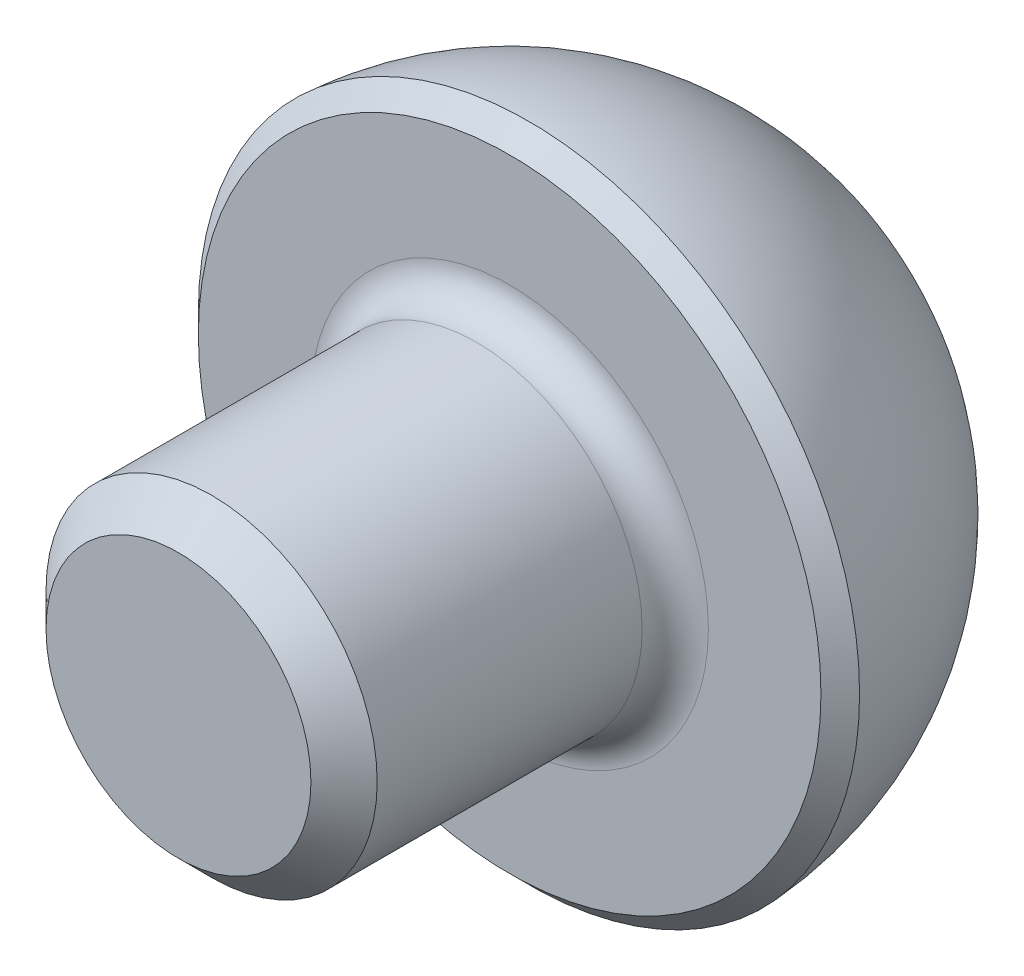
ISO-10303-21;
HEADER;
FILE_DESCRIPTION(('STEP AP214'),'2;1');
FILE_NAME('part.step','',(''),(''),'','','');
FILE_SCHEMA(('AUTOMOTIVE_DESIGN { 1 0 10303 214 1 1 1 1 }'));
ENDSEC;
DATA;
#1=APPLICATION_CONTEXT('core data for automotive mechanical design processes');
#2=APPLICATION_PROTOCOL_DEFINITION('international standard','automotive_design',2000,#1);
#3=PRODUCT_CONTEXT('',#1,'mechanical');
#4=PRODUCT('Part','Part','',(#3));
#5=PRODUCT_RELATED_PRODUCT_CATEGORY('part','',(#4));
#6=PRODUCT_DEFINITION_FORMATION('','',#4);
#7=PRODUCT_DEFINITION_CONTEXT('part definition',#1,'design');
#8=PRODUCT_DEFINITION('design','',#6,#7);
#9=PRODUCT_DEFINITION_SHAPE('','',#8);
#10=(LENGTH_UNIT() NAMED_UNIT(*) SI_UNIT(.MILLI.,.METRE.));
#11=(NAMED_UNIT(*) PLANE_ANGLE_UNIT() SI_UNIT($,.RADIAN.));
#12=(NAMED_UNIT(*) SI_UNIT($,.STERADIAN.) SOLID_ANGLE_UNIT());
#13=UNCERTAINTY_MEASURE_WITH_UNIT(LENGTH_MEASURE(1.E-05),#10,'distance_accuracy_value','');
#14=(GEOMETRIC_REPRESENTATION_CONTEXT(3) GLOBAL_UNCERTAINTY_ASSIGNED_CONTEXT((#13)) GLOBAL_UNIT_ASSIGNED_CONTEXT((#10,
#11,#12)) REPRESENTATION_CONTEXT('',''));
#15=CARTESIAN_POINT('',(0.,0.,0.));
#16=DIRECTION('',(0.,0.,1.));
#17=DIRECTION('',(1.,0.,0.));
#18=AXIS2_PLACEMENT_3D('',#15,#16,#17);
#19=CARTESIAN_POINT('',(0.,0.,0.));
#20=DIRECTION('',(0.,0.,-1.));
#21=DIRECTION('',(-1.,0.,0.));
#22=AXIS2_PLACEMENT_3D('',#19,#20,#21);
#23=PLANE('',#22);
#24=CARTESIAN_POINT('',(0.,0.,0.));
#25=DIRECTION('',(0.,0.,-1.));
#26=DIRECTION('',(-1.,0.,0.));
#27=AXIS2_PLACEMENT_3D('',#24,#25,#26);
#28=CIRCLE('',#27,2.);
#29=CARTESIAN_POINT('',(-2.,0.,0.));
#30=VERTEX_POINT('',#29);
#31=EDGE_CURVE('E50',#30,#30,#28,.F.);
#32=ORIENTED_EDGE('',*,*,#31,.T.);
#33=EDGE_LOOP('',(#32));
#34=FACE_BOUND('',#33,.T.);
#35=ADVANCED_FACE('F30',(#34),#23,.F.);
#36=CARTESIAN_POINT('',(0.,0.,0.));
#37=DIRECTION('',(0.,0.,-1.));
#38=DIRECTION('',(-1.,0.,0.));
#39=AXIS2_PLACEMENT_3D('',#36,#37,#38);
#40=CYLINDRICAL_SURFACE('',#39,2.5);
#41=CARTESIAN_POINT('',(0.,0.,-4.50000000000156));
#42=DIRECTION('',(0.,0.,-1.));
#43=DIRECTION('',(-1.,0.,0.));
#44=AXIS2_PLACEMENT_3D('',#41,#42,#43);
#45=CIRCLE('',#44,2.5);
#46=CARTESIAN_POINT('',(-2.5,0.,-4.50000000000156));
#47=VERTEX_POINT('',#46);
#48=EDGE_CURVE('E41',#47,#47,#45,.F.);
#49=ORIENTED_EDGE('',*,*,#48,.T.);
#50=EDGE_LOOP('',(#49));
#51=FACE_BOUND('',#50,.T.);
#52=CARTESIAN_POINT('',(0.,0.,-0.5));
#53=DIRECTION('',(0.,0.,-1.));
#54=DIRECTION('',(-1.,0.,0.));
#55=AXIS2_PLACEMENT_3D('',#52,#53,#54);
#56=CIRCLE('',#55,2.5);
#57=CARTESIAN_POINT('',(-2.5,0.,-0.5));
#58=VERTEX_POINT('',#57);
#59=EDGE_CURVE('E53',#58,#58,#56,.T.);
#60=ORIENTED_EDGE('',*,*,#59,.T.);
#61=EDGE_LOOP('',(#60));
#62=FACE_BOUND('',#61,.T.);
#63=ADVANCED_FACE('F57',(#51,#62),#40,.T.);
#64=CARTESIAN_POINT('',(2.5,0.,-5.00000000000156));
#65=DIRECTION('',(0.,0.,-1.));
#66=DIRECTION('',(-1.,0.,0.));
#67=AXIS2_PLACEMENT_3D('',#64,#65,#66);
#68=PLANE('',#67);
#69=CARTESIAN_POINT('',(0.,0.,-5.00000000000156));
#70=DIRECTION('',(0.,0.,-1.));
#71=DIRECTION('',(-1.,0.,0.));
#72=AXIS2_PLACEMENT_3D('',#69,#70,#71);
#73=CIRCLE('',#72,4.69999999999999);
#74=CARTESIAN_POINT('',(-4.69999999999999,0.,-5.00000000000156));
#75=VERTEX_POINT('',#74);
#76=EDGE_CURVE('E10',#75,#75,#73,.F.);
#77=ORIENTED_EDGE('',*,*,#76,.T.);
#78=EDGE_LOOP('',(#77));
#79=FACE_BOUND('',#78,.T.);
#80=CARTESIAN_POINT('',(0.,0.,-5.00000000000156));
#81=DIRECTION('',(0.,0.,-1.));
#82=DIRECTION('',(-1.,0.,0.));
#83=AXIS2_PLACEMENT_3D('',#80,#81,#82);
#84=CIRCLE('',#83,3.);
#85=CARTESIAN_POINT('',(-3.,0.,-5.00000000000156));
#86=VERTEX_POINT('',#85);
#87=EDGE_CURVE('E45',#86,#86,#84,.T.);
#88=ORIENTED_EDGE('',*,*,#87,.T.);
#89=EDGE_LOOP('',(#88));
#90=FACE_BOUND('',#89,.T.);
#91=ADVANCED_FACE('F70',(#79,#90),#68,.F.);
#92=CARTESIAN_POINT('',(0.,0.,-5.00000000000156));
#93=DIRECTION('',(0.,0.,-1.));
#94=DIRECTION('',(1.,0.,0.));
#95=AXIS2_PLACEMENT_3D('',#92,#93,#94);
#96=SPHERICAL_SURFACE('',#95,5.);
#97=CARTESIAN_POINT('',(0.,0.,-5.29149578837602));
#98=DIRECTION('',(0.,0.,1.));
#99=DIRECTION('',(1.,0.,0.));
#100=AXIS2_PLACEMENT_3D('',#97,#98,#99);
#101=CIRCLE('',#100,4.99149578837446);
#102=CARTESIAN_POINT('',(4.99149578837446,0.,-5.29149578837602));
#103=VERTEX_POINT('',#102);
#104=EDGE_CURVE('E37',#103,#103,#101,.F.);
#105=ORIENTED_EDGE('',*,*,#104,.T.);
#106=EDGE_LOOP('',(#105));
#107=FACE_BOUND('',#106,.T.);
#108=ADVANCED_FACE('F62',(#107),#96,.T.);
#109=CARTESIAN_POINT('',(0.,0.,-0.5));
#110=DIRECTION('',(0.,0.,-1.));
#111=DIRECTION('',(-1.,0.,0.));
#112=AXIS2_PLACEMENT_3D('',#109,#110,#111);
#113=CONICAL_SURFACE('',#112,2.5,0.785398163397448);
#114=ORIENTED_EDGE('',*,*,#31,.F.);
#115=EDGE_LOOP('',(#114));
#116=FACE_BOUND('',#115,.T.);
#117=ORIENTED_EDGE('',*,*,#59,.F.);
#118=EDGE_LOOP('',(#117));
#119=FACE_BOUND('',#118,.T.);
#120=ADVANCED_FACE('F59',(#116,#119),#113,.T.);
#121=CARTESIAN_POINT('',(0.,0.,-4.50000000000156));
#122=DIRECTION('',(0.,0.,-1.));
#123=DIRECTION('',(-1.,0.,0.));
#124=AXIS2_PLACEMENT_3D('',#121,#122,#123);
#125=TOROIDAL_SURFACE('',#124,3.,0.5);
#126=ORIENTED_EDGE('',*,*,#48,.F.);
#127=EDGE_LOOP('',(#126));
#128=FACE_BOUND('',#127,.T.);
#129=ORIENTED_EDGE('',*,*,#87,.F.);
#130=EDGE_LOOP('',(#129));
#131=FACE_BOUND('',#130,.T.);
#132=ADVANCED_FACE('F61',(#128,#131),#125,.F.);
#133=CARTESIAN_POINT('',(0.,0.,-5.29149578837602));
#134=DIRECTION('',(0.,0.,-1.));
#135=DIRECTION('',(-1.,0.,0.));
#136=AXIS2_PLACEMENT_3D('',#133,#134,#135);
#137=CONICAL_SURFACE('',#136,4.99149578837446,0.785398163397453);
#138=ORIENTED_EDGE('',*,*,#76,.F.);
#139=EDGE_LOOP('',(#138));
#140=FACE_BOUND('',#139,.T.);
#141=ORIENTED_EDGE('',*,*,#104,.F.);
#142=EDGE_LOOP('',(#141));
#143=FACE_BOUND('',#142,.T.);
#144=ADVANCED_FACE('F32',(#140,#143),#137,.T.);
#145=CLOSED_SHELL('',(#35,#63,#91,#108,#120,#132,#144));
#146=MANIFOLD_SOLID_BREP('B2',#145);
#147=ADVANCED_BREP_SHAPE_REPRESENTATION('',(#18,#146),#14);
#148=SHAPE_DEFINITION_REPRESENTATION(#9,#147);
ENDSEC;
END-ISO-10303-21;
